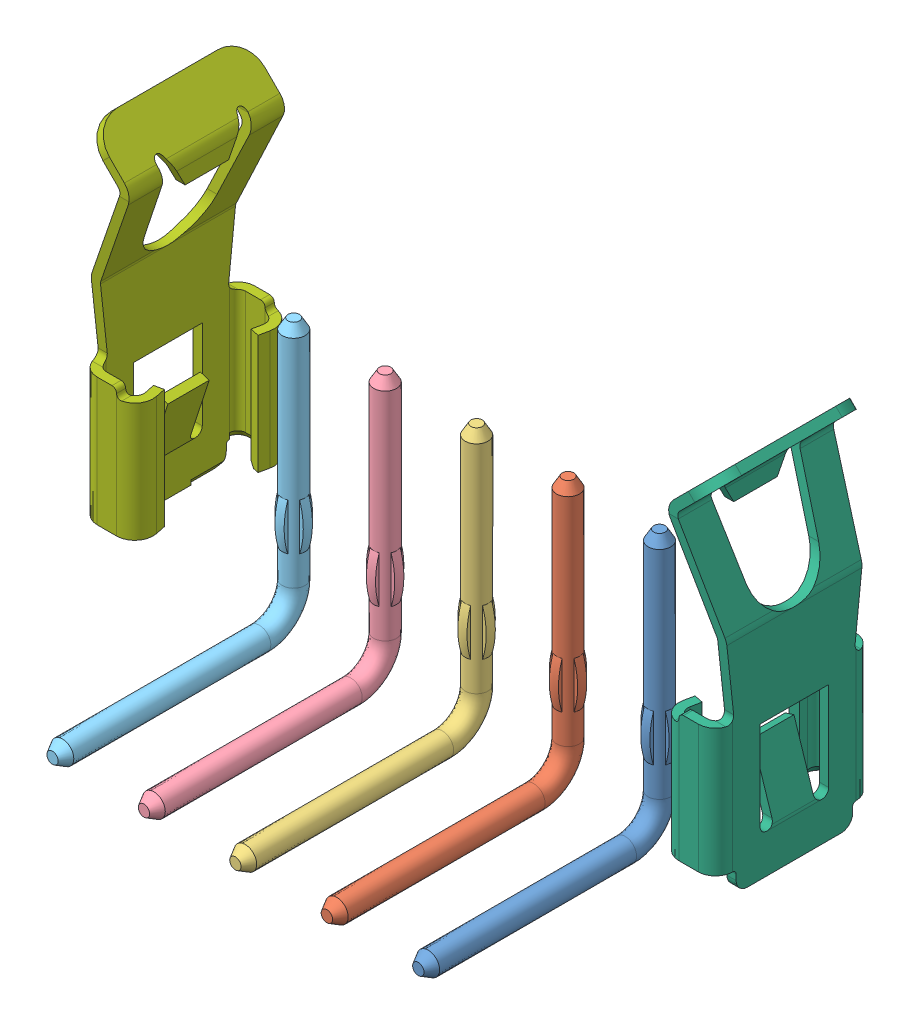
SolidWorks assembly m80-8420542_asm.SLDASM, configuration Default (file format 6000). Lengths in mm.
Overall size (13.9 9.1 7).
8 component instances, 7 part files, 0 mates.
Components (placement in the parent):
- M80-8780522-1: M80-8780522.sldasm [Default] at origin size (8.8 5.95 5.68)
  - M80-878-PIN_6-1: M80-878-PIN_6.sldprt [Default] at origin size (0.8 5.95 5.68)
  - M80-878-PIN_1_2-1: M80-878-PIN_1_2.sldprt [Default] at origin size (0.8 5.95 5.68)
  - M80-878-PIN_2_1-1: M80-878-PIN_2_1.sldprt [Default] at origin size (0.8 5.95 5.68)
  - M80-878-PIN_3_1-1: M80-878-PIN_3_1.sldprt [Default] at origin size (0.8 5.95 5.68)
  - M80-878-PIN_4_1-1: M80-878-PIN_4_1.sldprt [Default] at origin size (0.8 5.95 5.68)
- M80-001XXXX_5-1: M80-001XXXX_5.sldprt [Default] at origin size (1.2 7.95 3.45)
- M80-001XXXX_1_4-1: M80-001XXXX_1_4.sldprt [Default] at origin size (1.2 7.95 3.45)
